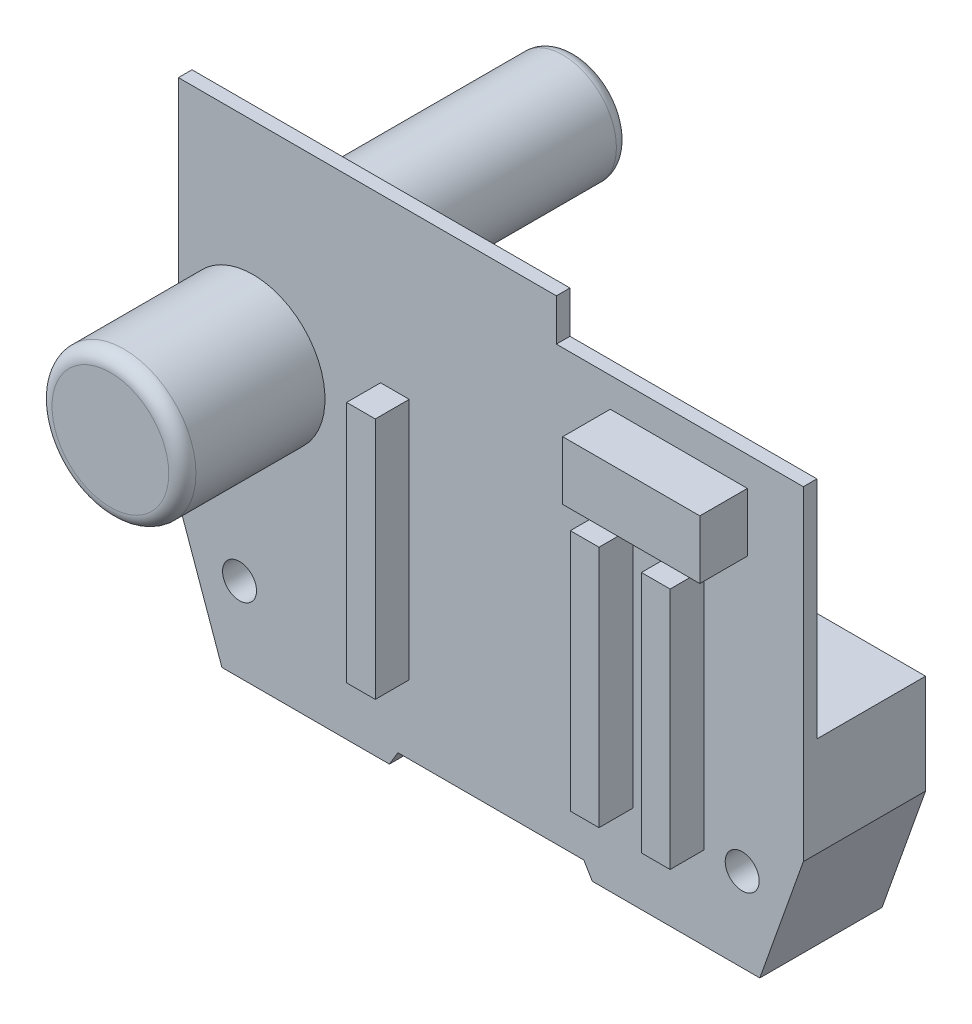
from build123d import *

# Parameters (mm, degrees)
ESQUISSE1_R             = 2.5
EXTRUSION1_DEPTH        = 2
ESQUISSE2_R             = 10.593150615
EXTRUSION2_DEPTH        = 21
ESQUISSE3_W             = 20.184853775
ESQUISSE3_H             = 8.631281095
EXTRUSION3_DEPTH        = 7
ESQUISSE4_W             = 4.219074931
ESQUISSE4_H             = 35.760383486
ESQUISSE4_W_2           = 4.219074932
ESQUISSE4_H_2           = 35.760383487
EXTRUSION4_DEPTH        = 5
EXTRUSION5_DEPTH        = 16
ESQUISSE6_R             = 7.879927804
EXTRUSION6_DEPTH        = 36
CONG_1_R                = 2
ESQUISSE7_R             = 2.5
ENL_V_MAT_EXTRU_1_DEPTH = 123.245654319


with BuildPart() as part:
    # Esquisse1 → Extrusion1 (new body)
    with BuildSketch(Plane.XY):
        Polygon((-36.356352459, 72), (-36.356352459, 65.842213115), (0, 65.842213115), (0, 18.035040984), (-6.405122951, 0), (-31.065480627, 0), (-32.317535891, 2.086694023), (-59.682464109, 2.086694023), (-60.934519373, 0), (-85.594877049, 0), (-92, 18.035040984), (-92, 72), align=None)
        with Locations((-83, 12.309631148)):
            Circle(ESQUISSE1_R, mode=Mode.SUBTRACT)
        with Locations(Location((-9, 12.309631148, 0), (0, 0, 180))):
            Circle(ESQUISSE1_R, mode=Mode.SUBTRACT)
    extrude(amount=EXTRUSION1_DEPTH)

    # Esquisse2 → Extrusion2 (add)
    with BuildSketch(Plane.XY.offset(2)):
        with Locations(Location((-81.011586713, 41.795688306, 0), (0, 0, 180))):
            Circle(ESQUISSE2_R)
    extrude(amount=EXTRUSION2_DEPTH)

    # Esquisse3 → Extrusion3 (add)
    with BuildSketch(Plane.XY.offset(2)):
        with Locations((-18.327572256, 57.190685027)):
            Rectangle(ESQUISSE3_W, ESQUISSE3_H)
    extrude(amount=EXTRUSION3_DEPTH)

    # Esquisse4 → Extrusion4 (add)
    with BuildSketch(Plane.XY.offset(2)):
        with Locations((-27.189587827, 30.207620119)):
            Rectangle(ESQUISSE4_W, ESQUISSE4_H)
        with Locations((-16.723364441, 30.108589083)):
            Rectangle(ESQUISSE4_W_2, ESQUISSE4_H_2)
        with Locations((-60.125420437, 30.091888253)):
            Rectangle(ESQUISSE4_W_2, ESQUISSE4_H_2)
    extrude(amount=EXTRUSION4_DEPTH)

    # Esquisse5 → Extrusion5 (add)
    with BuildSketch(Plane(origin=(0, 0, 0), x_dir=(-1, 0, 0), z_dir=(0, 0, -1))):
        Polygon((0, 32.687758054), (92, 32.687758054), (92, 18.035040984), (85.594877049, 0), (60.934519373, 0), (59.682464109, 2.086694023), (32.317535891, 2.086694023), (31.065480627, 0), (6.405122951, 0), (0, 18.035040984), align=None)
    extrude(amount=EXTRUSION5_DEPTH)

    # Esquisse6 → Extrusion6 (add)
    with BuildSketch(Plane(origin=(0, 0, 0), x_dir=(-1, 0, 0), z_dir=(0, 0, -1))):
        with Locations(Location((71.39717635, 59.311323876, 0), (0, 0, 180))):
            Circle(ESQUISSE6_R)
    extrude(amount=EXTRUSION6_DEPTH)

    # Cong_1
    cong_1_edges = [part.edges().sort_by_distance(p)[0] for p in [
        (-79.277104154, 59.311323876, -36),
        (-70.418436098, 41.795688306, 23),
    ]]
    fillet(cong_1_edges, radius=CONG_1_R)

    # Esquisse7 → Enl_v. mat.-Extru.1 (cut, through all)
    with BuildSketch(Plane.XY):
        with Locations((-83, 12.309631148)):
            Circle(ESQUISSE7_R)
        with Locations(Location((-9, 12.309631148, 0), (0, 0, 180))):
            Circle(ESQUISSE7_R)
    extrude(amount=-ENL_V_MAT_EXTRU_1_DEPTH, mode=Mode.SUBTRACT)


solid = part.part
